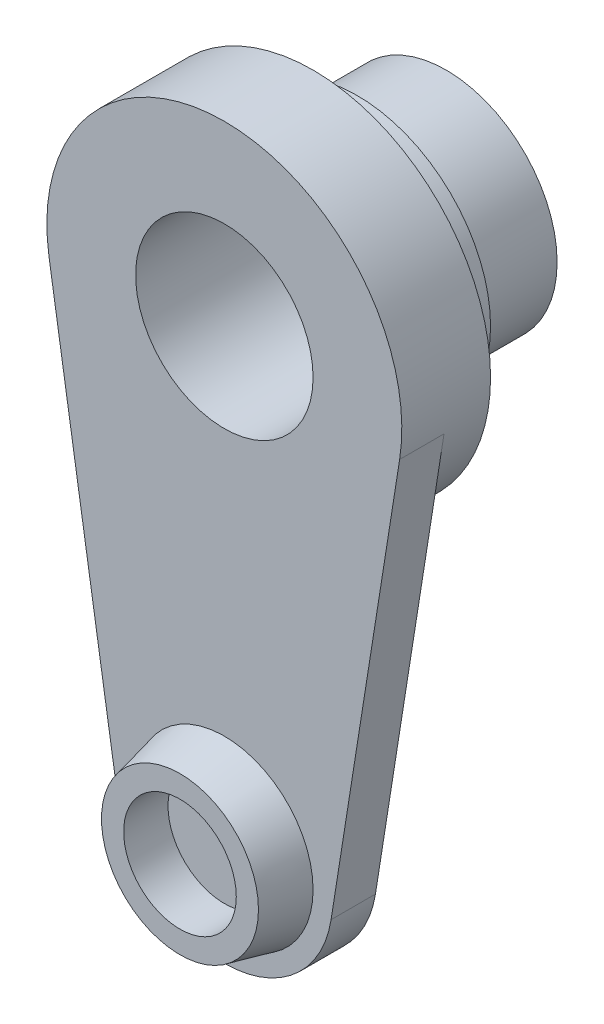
ISO-10303-21;
HEADER;
FILE_DESCRIPTION(('STEP AP214'),'2;1');
FILE_NAME('part.step','',(''),(''),'','','');
FILE_SCHEMA(('AUTOMOTIVE_DESIGN { 1 0 10303 214 1 1 1 1 }'));
ENDSEC;
DATA;
#1=APPLICATION_CONTEXT('core data for automotive mechanical design processes');
#2=APPLICATION_PROTOCOL_DEFINITION('international standard','automotive_design',2000,#1);
#3=PRODUCT_CONTEXT('',#1,'mechanical');
#4=PRODUCT('Part','Part','',(#3));
#5=PRODUCT_RELATED_PRODUCT_CATEGORY('part','',(#4));
#6=PRODUCT_DEFINITION_FORMATION('','',#4);
#7=PRODUCT_DEFINITION_CONTEXT('part definition',#1,'design');
#8=PRODUCT_DEFINITION('design','',#6,#7);
#9=PRODUCT_DEFINITION_SHAPE('','',#8);
#10=(LENGTH_UNIT() NAMED_UNIT(*) SI_UNIT(.MILLI.,.METRE.));
#11=(NAMED_UNIT(*) PLANE_ANGLE_UNIT() SI_UNIT($,.RADIAN.));
#12=(NAMED_UNIT(*) SI_UNIT($,.STERADIAN.) SOLID_ANGLE_UNIT());
#13=UNCERTAINTY_MEASURE_WITH_UNIT(LENGTH_MEASURE(1.E-05),#10,'distance_accuracy_value','');
#14=(GEOMETRIC_REPRESENTATION_CONTEXT(3) GLOBAL_UNCERTAINTY_ASSIGNED_CONTEXT((#13)) GLOBAL_UNIT_ASSIGNED_CONTEXT((#10,
#11,#12)) REPRESENTATION_CONTEXT('',''));
#15=CARTESIAN_POINT('',(0.,0.,0.));
#16=DIRECTION('',(0.,0.,1.));
#17=DIRECTION('',(1.,0.,0.));
#18=AXIS2_PLACEMENT_3D('',#15,#16,#17);
#19=CARTESIAN_POINT('',(0.,0.,15.875));
#20=DIRECTION('',(0.,0.,1.));
#21=DIRECTION('',(1.,0.,0.));
#22=AXIS2_PLACEMENT_3D('',#19,#20,#21);
#23=PLANE('',#22);
#24=CARTESIAN_POINT('',(0.,0.,15.875));
#25=DIRECTION('',(0.,0.,1.));
#26=DIRECTION('',(1.,0.,0.));
#27=AXIS2_PLACEMENT_3D('',#24,#25,#26);
#28=CIRCLE('',#27,6.35);
#29=CARTESIAN_POINT('',(6.35,0.,15.875));
#30=VERTEX_POINT('',#29);
#31=EDGE_CURVE('E90',#30,#30,#28,.T.);
#32=ORIENTED_EDGE('',*,*,#31,.F.);
#33=EDGE_LOOP('',(#32));
#34=FACE_BOUND('',#33,.T.);
#35=CARTESIAN_POINT('',(0.,0.,15.875));
#36=DIRECTION('',(0.,0.,1.));
#37=DIRECTION('',(1.,0.,0.));
#38=AXIS2_PLACEMENT_3D('',#35,#36,#37);
#39=CIRCLE('',#38,12.7);
#40=CARTESIAN_POINT('',(12.5436419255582,-1.98671770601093,15.875));
#41=VERTEX_POINT('',#40);
#42=CARTESIAN_POINT('',(-12.5436419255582,-1.98671770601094,15.875));
#43=VERTEX_POINT('',#42);
#44=EDGE_CURVE('E107',#41,#43,#39,.T.);
#45=ORIENTED_EDGE('',*,*,#44,.T.);
#46=DIRECTION('',(0.156434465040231,-0.987688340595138,0.));
#47=VECTOR('',#46,1.);
#48=CARTESIAN_POINT('',(-12.5436419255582,-1.98671770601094,15.875));
#49=LINE('',#48,#47);
#50=CARTESIAN_POINT('',(-7.63799713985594,-32.9597399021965,15.875));
#51=VERTEX_POINT('',#50);
#52=EDGE_CURVE('E93',#43,#51,#49,.T.);
#53=ORIENTED_EDGE('',*,*,#52,.T.);
#54=CARTESIAN_POINT('',(0.,-31.75,15.875));
#55=DIRECTION('',(0.,0.,1.));
#56=DIRECTION('',(1.,0.,0.));
#57=AXIS2_PLACEMENT_3D('',#54,#55,#56);
#58=CIRCLE('',#57,7.73320573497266);
#59=CARTESIAN_POINT('',(7.63799713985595,-32.9597399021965,15.875));
#60=VERTEX_POINT('',#59);
#61=EDGE_CURVE('E111',#51,#60,#58,.T.);
#62=ORIENTED_EDGE('',*,*,#61,.T.);
#63=DIRECTION('',(0.156434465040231,0.987688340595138,0.));
#64=VECTOR('',#63,1.);
#65=CARTESIAN_POINT('',(12.5436419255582,-1.98671770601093,15.875));
#66=LINE('',#65,#64);
#67=EDGE_CURVE('E54',#60,#41,#66,.T.);
#68=ORIENTED_EDGE('',*,*,#67,.T.);
#69=EDGE_LOOP('',(#45,#53,#62,#68));
#70=FACE_BOUND('',#69,.T.);
#71=CARTESIAN_POINT('',(0.,-31.75,15.875));
#72=DIRECTION('',(0.,0.,1.));
#73=DIRECTION('',(1.,0.,0.));
#74=AXIS2_PLACEMENT_3D('',#71,#72,#73);
#75=CIRCLE('',#74,6.35);
#76=CARTESIAN_POINT('',(6.35,-31.75,15.875));
#77=VERTEX_POINT('',#76);
#78=EDGE_CURVE('E146',#77,#77,#75,.T.);
#79=ORIENTED_EDGE('',*,*,#78,.F.);
#80=EDGE_LOOP('',(#79));
#81=FACE_BOUND('',#80,.T.);
#82=ADVANCED_FACE('F29',(#34,#70,#81),#23,.T.);
#83=CARTESIAN_POINT('',(0.,0.,0.));
#84=DIRECTION('',(0.,0.,1.));
#85=DIRECTION('',(1.,0.,0.));
#86=AXIS2_PLACEMENT_3D('',#83,#84,#85);
#87=PLANE('',#86);
#88=CARTESIAN_POINT('',(0.,0.,0.));
#89=DIRECTION('',(0.,0.,1.));
#90=DIRECTION('',(1.,0.,0.));
#91=AXIS2_PLACEMENT_3D('',#88,#89,#90);
#92=CIRCLE('',#91,7.9375);
#93=CARTESIAN_POINT('',(7.9375,0.,0.));
#94=VERTEX_POINT('',#93);
#95=EDGE_CURVE('E38',#94,#94,#92,.T.);
#96=ORIENTED_EDGE('',*,*,#95,.F.);
#97=EDGE_LOOP('',(#96));
#98=FACE_BOUND('',#97,.T.);
#99=CARTESIAN_POINT('',(0.,0.,0.));
#100=DIRECTION('',(0.,0.,1.));
#101=DIRECTION('',(1.,0.,0.));
#102=AXIS2_PLACEMENT_3D('',#99,#100,#101);
#103=CIRCLE('',#102,6.35);
#104=CARTESIAN_POINT('',(6.35,0.,0.));
#105=VERTEX_POINT('',#104);
#106=EDGE_CURVE('E121',#105,#105,#103,.T.);
#107=ORIENTED_EDGE('',*,*,#106,.T.);
#108=EDGE_LOOP('',(#107));
#109=FACE_BOUND('',#108,.T.);
#110=ADVANCED_FACE('F130',(#98,#109),#87,.F.);
#111=CARTESIAN_POINT('',(0.,0.,6.35));
#112=DIRECTION('',(0.,0.,-1.));
#113=DIRECTION('',(-1.,0.,0.));
#114=AXIS2_PLACEMENT_3D('',#111,#112,#113);
#115=CYLINDRICAL_SURFACE('',#114,7.9375);
#116=CARTESIAN_POINT('',(0.,0.,6.35));
#117=DIRECTION('',(0.,0.,1.));
#118=DIRECTION('',(1.,0.,0.));
#119=AXIS2_PLACEMENT_3D('',#116,#117,#118);
#120=CIRCLE('',#119,7.9375);
#121=CARTESIAN_POINT('',(7.9375,0.,6.35));
#122=VERTEX_POINT('',#121);
#123=EDGE_CURVE('E11',#122,#122,#120,.T.);
#124=ORIENTED_EDGE('',*,*,#123,.F.);
#125=EDGE_LOOP('',(#124));
#126=FACE_BOUND('',#125,.T.);
#127=ORIENTED_EDGE('',*,*,#95,.T.);
#128=EDGE_LOOP('',(#127));
#129=FACE_BOUND('',#128,.T.);
#130=ADVANCED_FACE('F31',(#126,#129),#115,.T.);
#131=CARTESIAN_POINT('',(0.,0.,6.35));
#132=DIRECTION('',(0.,0.,-1.));
#133=DIRECTION('',(-1.,0.,0.));
#134=AXIS2_PLACEMENT_3D('',#131,#132,#133);
#135=CYLINDRICAL_SURFACE('',#134,6.35);
#136=ORIENTED_EDGE('',*,*,#106,.F.);
#137=EDGE_LOOP('',(#136));
#138=FACE_BOUND('',#137,.T.);
#139=ORIENTED_EDGE('',*,*,#31,.T.);
#140=EDGE_LOOP('',(#139));
#141=FACE_BOUND('',#140,.T.);
#142=ADVANCED_FACE('F135',(#138,#141),#135,.F.);
#143=CARTESIAN_POINT('',(0.,0.,6.35));
#144=DIRECTION('',(0.,0.,1.));
#145=DIRECTION('',(1.,0.,0.));
#146=AXIS2_PLACEMENT_3D('',#143,#144,#145);
#147=PLANE('',#146);
#148=CARTESIAN_POINT('',(0.,0.,6.35));
#149=DIRECTION('',(0.,0.,1.));
#150=DIRECTION('',(1.,0.,0.));
#151=AXIS2_PLACEMENT_3D('',#148,#149,#150);
#152=CIRCLE('',#151,9.525);
#153=CARTESIAN_POINT('',(9.525,0.,6.35));
#154=VERTEX_POINT('',#153);
#155=EDGE_CURVE('E80',#154,#154,#152,.T.);
#156=ORIENTED_EDGE('',*,*,#155,.F.);
#157=EDGE_LOOP('',(#156));
#158=FACE_BOUND('',#157,.T.);
#159=ORIENTED_EDGE('',*,*,#123,.T.);
#160=EDGE_LOOP('',(#159));
#161=FACE_BOUND('',#160,.T.);
#162=ADVANCED_FACE('F138',(#158,#161),#147,.F.);
#163=CARTESIAN_POINT('',(0.,0.,9.525));
#164=DIRECTION('',(0.,0.,-1.));
#165=DIRECTION('',(-1.,0.,0.));
#166=AXIS2_PLACEMENT_3D('',#163,#164,#165);
#167=CYLINDRICAL_SURFACE('',#166,9.525);
#168=CARTESIAN_POINT('',(0.,0.,9.525));
#169=DIRECTION('',(0.,0.,1.));
#170=DIRECTION('',(1.,0.,0.));
#171=AXIS2_PLACEMENT_3D('',#168,#169,#170);
#172=CIRCLE('',#171,9.525);
#173=CARTESIAN_POINT('',(9.525,0.,9.525));
#174=VERTEX_POINT('',#173);
#175=EDGE_CURVE('E118',#174,#174,#172,.T.);
#176=ORIENTED_EDGE('',*,*,#175,.F.);
#177=EDGE_LOOP('',(#176));
#178=FACE_BOUND('',#177,.T.);
#179=ORIENTED_EDGE('',*,*,#155,.T.);
#180=EDGE_LOOP('',(#179));
#181=FACE_BOUND('',#180,.T.);
#182=ADVANCED_FACE('F270',(#178,#181),#167,.T.);
#183=CARTESIAN_POINT('',(0.,0.,9.525));
#184=DIRECTION('',(0.,0.,1.));
#185=DIRECTION('',(1.,0.,0.));
#186=AXIS2_PLACEMENT_3D('',#183,#184,#185);
#187=PLANE('',#186);
#188=CARTESIAN_POINT('',(0.,0.,9.525));
#189=DIRECTION('',(0.,0.,1.));
#190=DIRECTION('',(1.,0.,0.));
#191=AXIS2_PLACEMENT_3D('',#188,#189,#190);
#192=CIRCLE('',#191,12.7);
#193=CARTESIAN_POINT('',(12.7,0.,9.525));
#194=VERTEX_POINT('',#193);
#195=EDGE_CURVE('E81',#194,#194,#192,.T.);
#196=ORIENTED_EDGE('',*,*,#195,.F.);
#197=EDGE_LOOP('',(#196));
#198=FACE_BOUND('',#197,.T.);
#199=ORIENTED_EDGE('',*,*,#175,.T.);
#200=EDGE_LOOP('',(#199));
#201=FACE_BOUND('',#200,.T.);
#202=ADVANCED_FACE('F251',(#198,#201),#187,.F.);
#203=CARTESIAN_POINT('',(0.,0.,12.7));
#204=DIRECTION('',(0.,0.,-1.));
#205=DIRECTION('',(-1.,0.,0.));
#206=AXIS2_PLACEMENT_3D('',#203,#204,#205);
#207=CYLINDRICAL_SURFACE('',#206,12.7);
#208=CARTESIAN_POINT('',(0.,0.,12.7));
#209=DIRECTION('',(0.,0.,1.));
#210=DIRECTION('',(1.,0.,0.));
#211=AXIS2_PLACEMENT_3D('',#208,#209,#210);
#212=CIRCLE('',#211,12.7);
#213=CARTESIAN_POINT('',(-12.5436419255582,-1.98671770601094,12.7));
#214=VERTEX_POINT('',#213);
#215=CARTESIAN_POINT('',(12.5436419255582,-1.98671770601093,12.7));
#216=VERTEX_POINT('',#215);
#217=EDGE_CURVE('E46',#214,#216,#212,.T.);
#218=ORIENTED_EDGE('',*,*,#217,.F.);
#219=DIRECTION('',(0.,0.,-1.));
#220=VECTOR('',#219,1.);
#221=CARTESIAN_POINT('',(-12.5436419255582,-1.98671770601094,15.875));
#222=LINE('',#221,#220);
#223=EDGE_CURVE('E78',#43,#214,#222,.T.);
#224=ORIENTED_EDGE('',*,*,#223,.F.);
#225=ORIENTED_EDGE('',*,*,#44,.F.);
#226=DIRECTION('',(0.,0.,-1.));
#227=VECTOR('',#226,1.);
#228=CARTESIAN_POINT('',(12.5436419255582,-1.98671770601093,15.875));
#229=LINE('',#228,#227);
#230=EDGE_CURVE('E79',#41,#216,#229,.T.);
#231=ORIENTED_EDGE('',*,*,#230,.T.);
#232=EDGE_LOOP('',(#218,#224,#225,#231));
#233=FACE_BOUND('',#232,.T.);
#234=ORIENTED_EDGE('',*,*,#195,.T.);
#235=EDGE_LOOP('',(#234));
#236=FACE_BOUND('',#235,.T.);
#237=ADVANCED_FACE('F74',(#233,#236),#207,.T.);
#238=CARTESIAN_POINT('',(0.,0.,12.7));
#239=DIRECTION('',(0.,0.,1.));
#240=DIRECTION('',(1.,0.,0.));
#241=AXIS2_PLACEMENT_3D('',#238,#239,#240);
#242=PLANE('',#241);
#243=DIRECTION('',(0.156434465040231,-0.987688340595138,0.));
#244=VECTOR('',#243,1.);
#245=CARTESIAN_POINT('',(-12.5436419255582,-1.98671770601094,12.7));
#246=LINE('',#245,#244);
#247=CARTESIAN_POINT('',(-7.63799713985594,-32.9597399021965,12.7));
#248=VERTEX_POINT('',#247);
#249=EDGE_CURVE('E84',#214,#248,#246,.T.);
#250=ORIENTED_EDGE('',*,*,#249,.F.);
#251=ORIENTED_EDGE('',*,*,#217,.T.);
#252=DIRECTION('',(0.156434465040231,0.987688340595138,0.));
#253=VECTOR('',#252,1.);
#254=CARTESIAN_POINT('',(12.5436419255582,-1.98671770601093,12.7));
#255=LINE('',#254,#253);
#256=CARTESIAN_POINT('',(7.63799713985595,-32.9597399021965,12.7));
#257=VERTEX_POINT('',#256);
#258=EDGE_CURVE('E105',#257,#216,#255,.T.);
#259=ORIENTED_EDGE('',*,*,#258,.F.);
#260=CARTESIAN_POINT('',(0.,-31.75,12.7));
#261=DIRECTION('',(0.,0.,1.));
#262=DIRECTION('',(1.,0.,0.));
#263=AXIS2_PLACEMENT_3D('',#260,#261,#262);
#264=CIRCLE('',#263,7.73320573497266);
#265=EDGE_CURVE('E86',#248,#257,#264,.T.);
#266=ORIENTED_EDGE('',*,*,#265,.F.);
#267=EDGE_LOOP('',(#250,#251,#259,#266));
#268=FACE_BOUND('',#267,.T.);
#269=ADVANCED_FACE('F85',(#268),#242,.F.);
#270=CARTESIAN_POINT('',(-12.5436419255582,-1.98671770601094,15.875));
#271=DIRECTION('',(0.987688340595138,0.156434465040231,0.));
#272=DIRECTION('',(-0.156434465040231,0.987688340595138,0.));
#273=AXIS2_PLACEMENT_3D('',#270,#271,#272);
#274=PLANE('',#273);
#275=ORIENTED_EDGE('',*,*,#249,.T.);
#276=DIRECTION('',(0.,0.,-1.));
#277=VECTOR('',#276,1.);
#278=CARTESIAN_POINT('',(-7.63799713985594,-32.9597399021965,15.875));
#279=LINE('',#278,#277);
#280=EDGE_CURVE('E94',#51,#248,#279,.T.);
#281=ORIENTED_EDGE('',*,*,#280,.F.);
#282=ORIENTED_EDGE('',*,*,#52,.F.);
#283=ORIENTED_EDGE('',*,*,#223,.T.);
#284=EDGE_LOOP('',(#275,#281,#282,#283));
#285=FACE_BOUND('',#284,.T.);
#286=ADVANCED_FACE('F92',(#285),#274,.F.);
#287=CARTESIAN_POINT('',(0.,-31.75,15.875));
#288=DIRECTION('',(0.,0.,-1.));
#289=DIRECTION('',(-1.,0.,0.));
#290=AXIS2_PLACEMENT_3D('',#287,#288,#289);
#291=CYLINDRICAL_SURFACE('',#290,7.73320573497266);
#292=ORIENTED_EDGE('',*,*,#265,.T.);
#293=DIRECTION('',(0.,0.,-1.));
#294=VECTOR('',#293,1.);
#295=CARTESIAN_POINT('',(7.63799713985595,-32.9597399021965,15.875));
#296=LINE('',#295,#294);
#297=EDGE_CURVE('E98',#60,#257,#296,.T.);
#298=ORIENTED_EDGE('',*,*,#297,.F.);
#299=ORIENTED_EDGE('',*,*,#61,.F.);
#300=ORIENTED_EDGE('',*,*,#280,.T.);
#301=EDGE_LOOP('',(#292,#298,#299,#300));
#302=FACE_BOUND('',#301,.T.);
#303=ADVANCED_FACE('F155',(#302),#291,.T.);
#304=CARTESIAN_POINT('',(12.5436419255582,-1.98671770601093,15.875));
#305=DIRECTION('',(-0.987688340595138,0.156434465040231,0.));
#306=DIRECTION('',(-0.156434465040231,-0.987688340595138,0.));
#307=AXIS2_PLACEMENT_3D('',#304,#305,#306);
#308=PLANE('',#307);
#309=ORIENTED_EDGE('',*,*,#258,.T.);
#310=ORIENTED_EDGE('',*,*,#230,.F.);
#311=ORIENTED_EDGE('',*,*,#67,.F.);
#312=ORIENTED_EDGE('',*,*,#297,.T.);
#313=EDGE_LOOP('',(#309,#310,#311,#312));
#314=FACE_BOUND('',#313,.T.);
#315=ADVANCED_FACE('F157',(#314),#308,.F.);
#316=CARTESIAN_POINT('',(0.,-31.75,15.875));
#317=DIRECTION('',(0.,0.,-1.));
#318=DIRECTION('',(1.,0.,0.));
#319=AXIS2_PLACEMENT_3D('',#316,#317,#318);
#320=CONICAL_SURFACE('',#319,6.35,0.226892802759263);
#321=CARTESIAN_POINT('',(0.,-31.75,19.05));
#322=DIRECTION('',(0.,0.,1.));
#323=DIRECTION('',(1.,0.,0.));
#324=AXIS2_PLACEMENT_3D('',#321,#322,#323);
#325=CIRCLE('',#324,5.61699349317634);
#326=CARTESIAN_POINT('',(5.61699349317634,-31.75,19.05));
#327=VERTEX_POINT('',#326);
#328=EDGE_CURVE('E143',#327,#327,#325,.T.);
#329=ORIENTED_EDGE('',*,*,#328,.F.);
#330=EDGE_LOOP('',(#329));
#331=FACE_BOUND('',#330,.T.);
#332=ORIENTED_EDGE('',*,*,#78,.T.);
#333=EDGE_LOOP('',(#332));
#334=FACE_BOUND('',#333,.T.);
#335=ADVANCED_FACE('F159',(#331,#334),#320,.T.);
#336=CARTESIAN_POINT('',(0.,-31.75,19.05));
#337=DIRECTION('',(0.,0.,1.));
#338=DIRECTION('',(1.,0.,0.));
#339=AXIS2_PLACEMENT_3D('',#336,#337,#338);
#340=PLANE('',#339);
#341=CARTESIAN_POINT('',(0.,-31.75,19.05));
#342=DIRECTION('',(0.,0.,1.));
#343=DIRECTION('',(1.,0.,0.));
#344=AXIS2_PLACEMENT_3D('',#341,#342,#343);
#345=CIRCLE('',#344,4.02949349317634);
#346=CARTESIAN_POINT('',(4.02949349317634,-31.75,19.05));
#347=VERTEX_POINT('',#346);
#348=EDGE_CURVE('E191',#347,#347,#345,.T.);
#349=ORIENTED_EDGE('',*,*,#348,.F.);
#350=EDGE_LOOP('',(#349));
#351=FACE_BOUND('',#350,.T.);
#352=ORIENTED_EDGE('',*,*,#328,.T.);
#353=EDGE_LOOP('',(#352));
#354=FACE_BOUND('',#353,.T.);
#355=ADVANCED_FACE('F165',(#351,#354),#340,.T.);
#356=CARTESIAN_POINT('',(0.,-31.75,4.47787130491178));
#357=DIRECTION('',(0.,0.,1.));
#358=DIRECTION('',(1.,0.,0.));
#359=AXIS2_PLACEMENT_3D('',#356,#357,#358);
#360=CYLINDRICAL_SURFACE('',#359,4.02949349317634);
#361=CARTESIAN_POINT('',(0.,-31.75,15.875));
#362=DIRECTION('',(0.,0.,1.));
#363=DIRECTION('',(1.,0.,0.));
#364=AXIS2_PLACEMENT_3D('',#361,#362,#363);
#365=CIRCLE('',#364,4.02949349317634);
#366=CARTESIAN_POINT('',(4.02949349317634,-31.75,15.875));
#367=VERTEX_POINT('',#366);
#368=EDGE_CURVE('E190',#367,#367,#365,.F.);
#369=ORIENTED_EDGE('',*,*,#368,.T.);
#370=EDGE_LOOP('',(#369));
#371=FACE_BOUND('',#370,.T.);
#372=ORIENTED_EDGE('',*,*,#348,.T.);
#373=EDGE_LOOP('',(#372));
#374=FACE_BOUND('',#373,.T.);
#375=ADVANCED_FACE('F178',(#371,#374),#360,.F.);
#376=CARTESIAN_POINT('',(0.,0.,15.875));
#377=DIRECTION('',(0.,0.,1.));
#378=DIRECTION('',(1.,0.,0.));
#379=AXIS2_PLACEMENT_3D('',#376,#377,#378);
#380=PLANE('',#379);
#381=ORIENTED_EDGE('',*,*,#368,.F.);
#382=EDGE_LOOP('',(#381));
#383=FACE_BOUND('',#382,.T.);
#384=ADVANCED_FACE('F182',(#383),#380,.T.);
#385=CLOSED_SHELL('',(#82,#110,#130,#142,#162,#182,#202,#237,#269,#286,#303,#315,#335,#355,#375,#384));
#386=MANIFOLD_SOLID_BREP('B2',#385);
#387=ADVANCED_BREP_SHAPE_REPRESENTATION('',(#18,#386),#14);
#388=SHAPE_DEFINITION_REPRESENTATION(#9,#387);
ENDSEC;
END-ISO-10303-21;
